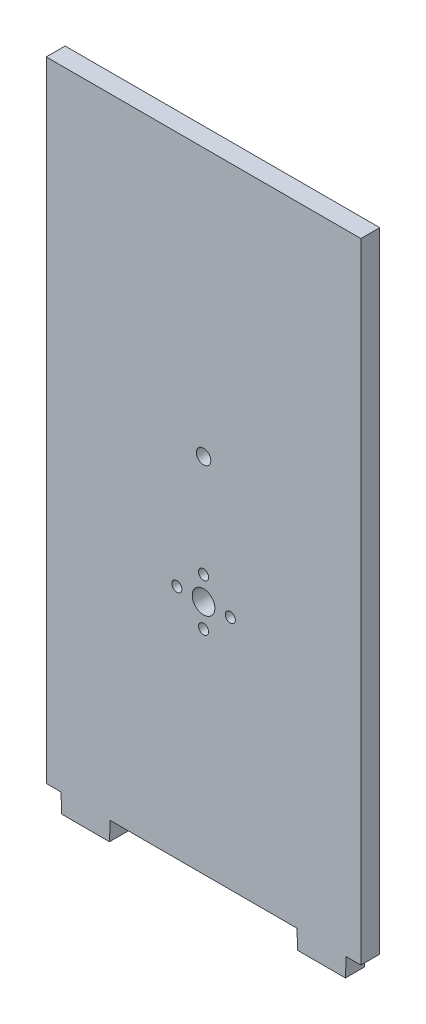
from build123d import *

# Parameters (mm, degrees)
SKETCH1_W           = 100
SKETCH1_H           = 200
BOSS_EXTRUDE1_DEPTH = 6
TABS_DEPTH          = 6
SKETCH5_R           = 3.6
SKETCH5_R_2         = 1.6
SKETCH5_R_3         = 2.3
AXLE_HOLES_DEPTH    = 6


with BuildPart() as part:
    # Sketch1 → Boss-Extrude1 (new body)
    with BuildSketch(Plane.XY):
        Rectangle(SKETCH1_W, SKETCH1_H)
    extrude(amount=BOSS_EXTRUDE1_DEPTH)

    # Sketch2 → tabs (add)
    with BuildSketch(Plane.XY.offset(6)):
        Polygon((-29.690475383, -100), (-45.309524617, -100), (-45.1, -106), (-29.9, -106), align=None)
        Polygon((45.309524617, -100), (29.690475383, -100), (29.9, -106), (45.1, -106), align=None)
    extrude(amount=-TABS_DEPTH)

    # Sketch5 → axle holes (cut)
    with BuildSketch(Plane.XY.offset(6)):
        with Locations((0, -25)):
            Circle(SKETCH5_R)
        with Locations((0, -17.5)):
            Circle(SKETCH5_R_2)
        with Locations((0, -32.5)):
            Circle(SKETCH5_R_2)
        with Locations((8.5, -25)):
            Circle(SKETCH5_R_2)
        with Locations((-8.5, -25)):
            Circle(SKETCH5_R_2)
        with Locations((0, 15)):
            Circle(SKETCH5_R_3)
    extrude(amount=-AXLE_HOLES_DEPTH, mode=Mode.SUBTRACT)


solid = part.part
